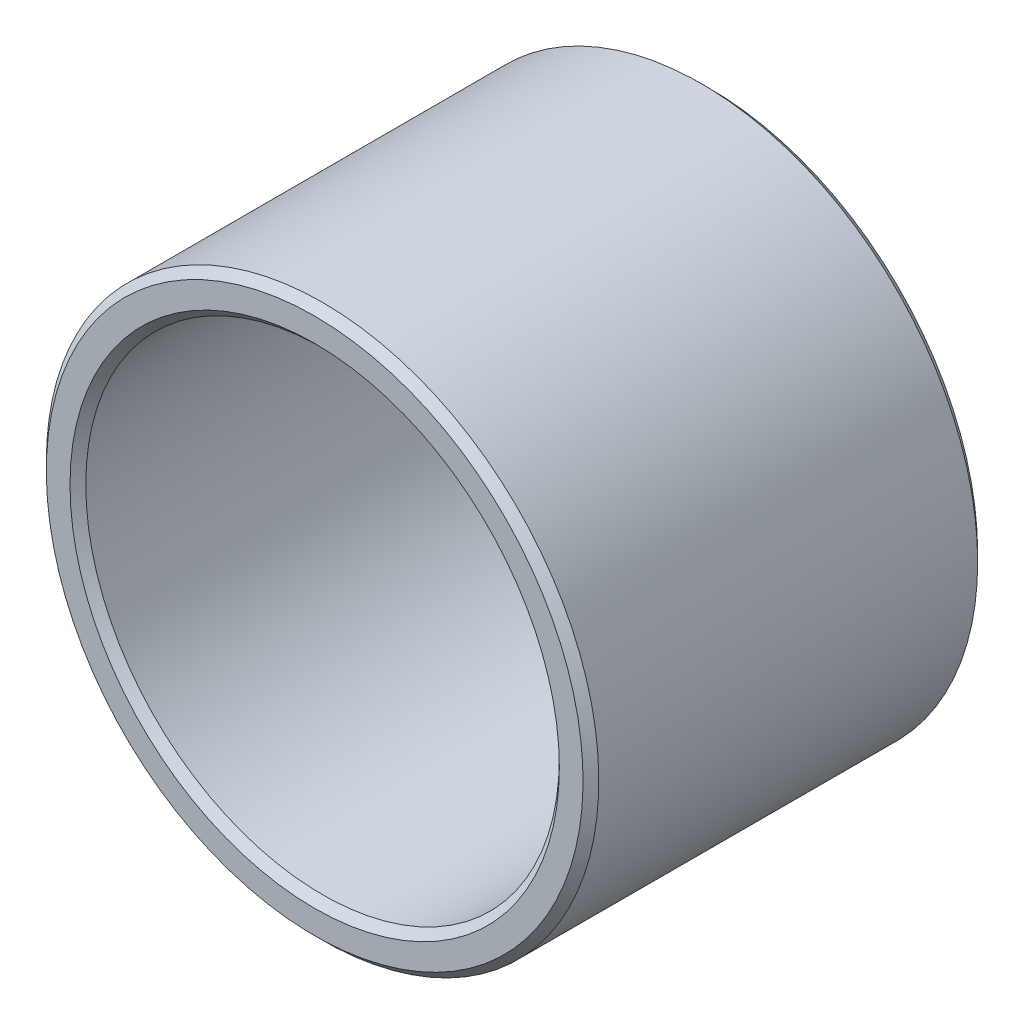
ISO-10303-21;
HEADER;
FILE_DESCRIPTION(('STEP AP214'),'2;1');
FILE_NAME('part.step','',(''),(''),'','','');
FILE_SCHEMA(('AUTOMOTIVE_DESIGN { 1 0 10303 214 1 1 1 1 }'));
ENDSEC;
DATA;
#1=APPLICATION_CONTEXT('core data for automotive mechanical design processes');
#2=APPLICATION_PROTOCOL_DEFINITION('international standard','automotive_design',2000,#1);
#3=PRODUCT_CONTEXT('',#1,'mechanical');
#4=PRODUCT('Part','Part','',(#3));
#5=PRODUCT_RELATED_PRODUCT_CATEGORY('part','',(#4));
#6=PRODUCT_DEFINITION_FORMATION('','',#4);
#7=PRODUCT_DEFINITION_CONTEXT('part definition',#1,'design');
#8=PRODUCT_DEFINITION('design','',#6,#7);
#9=PRODUCT_DEFINITION_SHAPE('','',#8);
#10=(LENGTH_UNIT() NAMED_UNIT(*) SI_UNIT(.MILLI.,.METRE.));
#11=(NAMED_UNIT(*) PLANE_ANGLE_UNIT() SI_UNIT($,.RADIAN.));
#12=(NAMED_UNIT(*) SI_UNIT($,.STERADIAN.) SOLID_ANGLE_UNIT());
#13=UNCERTAINTY_MEASURE_WITH_UNIT(LENGTH_MEASURE(1.E-05),#10,'distance_accuracy_value','');
#14=(GEOMETRIC_REPRESENTATION_CONTEXT(3) GLOBAL_UNCERTAINTY_ASSIGNED_CONTEXT((#13)) GLOBAL_UNIT_ASSIGNED_CONTEXT((#10,
#11,#12)) REPRESENTATION_CONTEXT('',''));
#15=CARTESIAN_POINT('',(0.,0.,0.));
#16=DIRECTION('',(0.,0.,1.));
#17=DIRECTION('',(1.,0.,0.));
#18=AXIS2_PLACEMENT_3D('',#15,#16,#17);
#19=CARTESIAN_POINT('',(0.,0.,0.));
#20=DIRECTION('',(0.,0.,-1.));
#21=DIRECTION('',(-1.,0.,0.));
#22=AXIS2_PLACEMENT_3D('',#19,#20,#21);
#23=CYLINDRICAL_SURFACE('',#22,6.);
#24=CARTESIAN_POINT('',(0.,0.,-9.79999999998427));
#25=DIRECTION('',(0.,0.,-1.));
#26=DIRECTION('',(-1.,0.,0.));
#27=AXIS2_PLACEMENT_3D('',#24,#25,#26);
#28=CIRCLE('',#27,5.99999999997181);
#29=CARTESIAN_POINT('',(-5.99999999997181,0.,-9.79999999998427));
#30=VERTEX_POINT('',#29);
#31=EDGE_CURVE('E31',#30,#30,#28,.F.);
#32=ORIENTED_EDGE('',*,*,#31,.F.);
#33=EDGE_LOOP('',(#32));
#34=FACE_BOUND('',#33,.T.);
#35=CARTESIAN_POINT('',(0.,0.,-0.200000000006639));
#36=DIRECTION('',(0.,0.,1.));
#37=DIRECTION('',(-1.,0.,0.));
#38=AXIS2_PLACEMENT_3D('',#35,#36,#37);
#39=CIRCLE('',#38,6.00000000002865);
#40=CARTESIAN_POINT('',(-6.00000000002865,0.,-0.200000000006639));
#41=VERTEX_POINT('',#40);
#42=EDGE_CURVE('E34',#41,#41,#39,.F.);
#43=ORIENTED_EDGE('',*,*,#42,.F.);
#44=EDGE_LOOP('',(#43));
#45=FACE_BOUND('',#44,.T.);
#46=ADVANCED_FACE('F15',(#34,#45),#23,.F.);
#47=CARTESIAN_POINT('',(0.,0.,-0.200000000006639));
#48=DIRECTION('',(0.,0.,1.));
#49=DIRECTION('',(1.,0.,0.));
#50=AXIS2_PLACEMENT_3D('',#47,#48,#49);
#51=CONICAL_SURFACE('',#50,6.00000000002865,0.785398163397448);
#52=ORIENTED_EDGE('',*,*,#42,.T.);
#53=EDGE_LOOP('',(#52));
#54=FACE_BOUND('',#53,.T.);
#55=CARTESIAN_POINT('',(0.,0.,-5.6843418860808E-11));
#56=DIRECTION('',(0.,0.,1.));
#57=DIRECTION('',(1.,0.,0.));
#58=AXIS2_PLACEMENT_3D('',#55,#56,#57);
#59=CIRCLE('',#58,6.19999999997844);
#60=CARTESIAN_POINT('',(6.19999999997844,0.,-5.6843418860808E-11));
#61=VERTEX_POINT('',#60);
#62=EDGE_CURVE('E19',#61,#61,#59,.T.);
#63=ORIENTED_EDGE('',*,*,#62,.T.);
#64=EDGE_LOOP('',(#63));
#65=FACE_BOUND('',#64,.T.);
#66=ADVANCED_FACE('F48',(#54,#65),#51,.F.);
#67=CARTESIAN_POINT('',(0.,0.,-9.79999999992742));
#68=DIRECTION('',(0.,0.,-1.));
#69=DIRECTION('',(-1.,0.,0.));
#70=AXIS2_PLACEMENT_3D('',#67,#68,#69);
#71=CONICAL_SURFACE('',#70,5.99999999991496,0.785398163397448);
#72=CARTESIAN_POINT('',(0.,0.,-10.0000000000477));
#73=DIRECTION('',(0.,0.,-1.));
#74=DIRECTION('',(-1.,0.,0.));
#75=AXIS2_PLACEMENT_3D('',#72,#73,#74);
#76=CIRCLE('',#75,6.20000000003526);
#77=CARTESIAN_POINT('',(-6.20000000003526,0.,-10.0000000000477));
#78=VERTEX_POINT('',#77);
#79=EDGE_CURVE('E41',#78,#78,#76,.F.);
#80=ORIENTED_EDGE('',*,*,#79,.F.);
#81=EDGE_LOOP('',(#80));
#82=FACE_BOUND('',#81,.T.);
#83=ORIENTED_EDGE('',*,*,#31,.T.);
#84=EDGE_LOOP('',(#83));
#85=FACE_BOUND('',#84,.T.);
#86=ADVANCED_FACE('F53',(#82,#85),#71,.F.);
#87=CARTESIAN_POINT('',(0.,0.,0.));
#88=DIRECTION('',(0.,0.,-1.));
#89=DIRECTION('',(-1.,0.,0.));
#90=AXIS2_PLACEMENT_3D('',#87,#88,#89);
#91=PLANE('',#90);
#92=CARTESIAN_POINT('',(0.,0.,-2.7672308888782E-11));
#93=DIRECTION('',(0.,0.,-1.));
#94=DIRECTION('',(0.,1.,0.));
#95=AXIS2_PLACEMENT_3D('',#92,#93,#94);
#96=CIRCLE('',#95,6.79999999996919);
#97=CARTESIAN_POINT('',(0.,6.79999999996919,-2.76722957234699E-11));
#98=VERTEX_POINT('',#97);
#99=EDGE_CURVE('E39',#98,#98,#96,.T.);
#100=ORIENTED_EDGE('',*,*,#99,.F.);
#101=EDGE_LOOP('',(#100));
#102=FACE_BOUND('',#101,.T.);
#103=ORIENTED_EDGE('',*,*,#62,.F.);
#104=EDGE_LOOP('',(#103));
#105=FACE_BOUND('',#104,.T.);
#106=ADVANCED_FACE('F50',(#102,#105),#91,.F.);
#107=CARTESIAN_POINT('',(0.,0.,-10.));
#108=DIRECTION('',(0.,0.,-1.));
#109=DIRECTION('',(-1.,0.,0.));
#110=AXIS2_PLACEMENT_3D('',#107,#108,#109);
#111=PLANE('',#110);
#112=ORIENTED_EDGE('',*,*,#79,.T.);
#113=EDGE_LOOP('',(#112));
#114=FACE_BOUND('',#113,.T.);
#115=CARTESIAN_POINT('',(0.,0.,-10.0000000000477));
#116=DIRECTION('',(0.,0.,1.));
#117=DIRECTION('',(1.,0.,0.));
#118=AXIS2_PLACEMENT_3D('',#115,#116,#117);
#119=CIRCLE('',#118,6.79999999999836);
#120=CARTESIAN_POINT('',(6.79999999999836,0.,-10.0000000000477));
#121=VERTEX_POINT('',#120);
#122=EDGE_CURVE('E28',#121,#121,#119,.T.);
#123=ORIENTED_EDGE('',*,*,#122,.F.);
#124=EDGE_LOOP('',(#123));
#125=FACE_BOUND('',#124,.T.);
#126=ADVANCED_FACE('F52',(#114,#125),#111,.T.);
#127=CARTESIAN_POINT('',(0.,0.,-0.199999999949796));
#128=DIRECTION('',(0.,0.,-1.));
#129=DIRECTION('',(0.,1.,0.));
#130=AXIS2_PLACEMENT_3D('',#127,#128,#129);
#131=CONICAL_SURFACE('',#130,6.99999999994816,0.785398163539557);
#132=ORIENTED_EDGE('',*,*,#99,.T.);
#133=EDGE_LOOP('',(#132));
#134=FACE_BOUND('',#133,.T.);
#135=CARTESIAN_POINT('',(0.,0.,-0.2));
#136=DIRECTION('',(0.,0.,-1.));
#137=DIRECTION('',(-1.,0.,0.));
#138=AXIS2_PLACEMENT_3D('',#135,#136,#137);
#139=CIRCLE('',#138,7.);
#140=CARTESIAN_POINT('',(-7.,0.,-0.2));
#141=VERTEX_POINT('',#140);
#142=EDGE_CURVE('E23',#141,#141,#139,.T.);
#143=ORIENTED_EDGE('',*,*,#142,.F.);
#144=EDGE_LOOP('',(#143));
#145=FACE_BOUND('',#144,.T.);
#146=ADVANCED_FACE('F61',(#134,#145),#131,.T.);
#147=CARTESIAN_POINT('',(0.,0.,-9.79999999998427));
#148=DIRECTION('',(0.,0.,1.));
#149=DIRECTION('',(1.,0.,0.));
#150=AXIS2_PLACEMENT_3D('',#147,#148,#149);
#151=CONICAL_SURFACE('',#150,7.000000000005,0.78539816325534);
#152=ORIENTED_EDGE('',*,*,#122,.T.);
#153=EDGE_LOOP('',(#152));
#154=FACE_BOUND('',#153,.T.);
#155=CARTESIAN_POINT('',(0.,0.,-9.8));
#156=DIRECTION('',(0.,0.,-1.));
#157=DIRECTION('',(-1.,0.,0.));
#158=AXIS2_PLACEMENT_3D('',#155,#156,#157);
#159=CIRCLE('',#158,7.);
#160=CARTESIAN_POINT('',(-7.,0.,-9.8));
#161=VERTEX_POINT('',#160);
#162=EDGE_CURVE('E10',#161,#161,#159,.F.);
#163=ORIENTED_EDGE('',*,*,#162,.F.);
#164=EDGE_LOOP('',(#163));
#165=FACE_BOUND('',#164,.T.);
#166=ADVANCED_FACE('F67',(#154,#165),#151,.T.);
#167=CARTESIAN_POINT('',(0.,0.,0.));
#168=DIRECTION('',(0.,0.,-1.));
#169=DIRECTION('',(-1.,0.,0.));
#170=AXIS2_PLACEMENT_3D('',#167,#168,#169);
#171=CYLINDRICAL_SURFACE('',#170,7.);
#172=ORIENTED_EDGE('',*,*,#142,.T.);
#173=EDGE_LOOP('',(#172));
#174=FACE_BOUND('',#173,.T.);
#175=ORIENTED_EDGE('',*,*,#162,.T.);
#176=EDGE_LOOP('',(#175));
#177=FACE_BOUND('',#176,.T.);
#178=ADVANCED_FACE('F17',(#174,#177),#171,.T.);
#179=CLOSED_SHELL('',(#46,#66,#86,#106,#126,#146,#166,#178));
#180=MANIFOLD_SOLID_BREP('B1',#179);
#181=ADVANCED_BREP_SHAPE_REPRESENTATION('',(#18,#180),#14);
#182=SHAPE_DEFINITION_REPRESENTATION(#9,#181);
ENDSEC;
END-ISO-10303-21;
